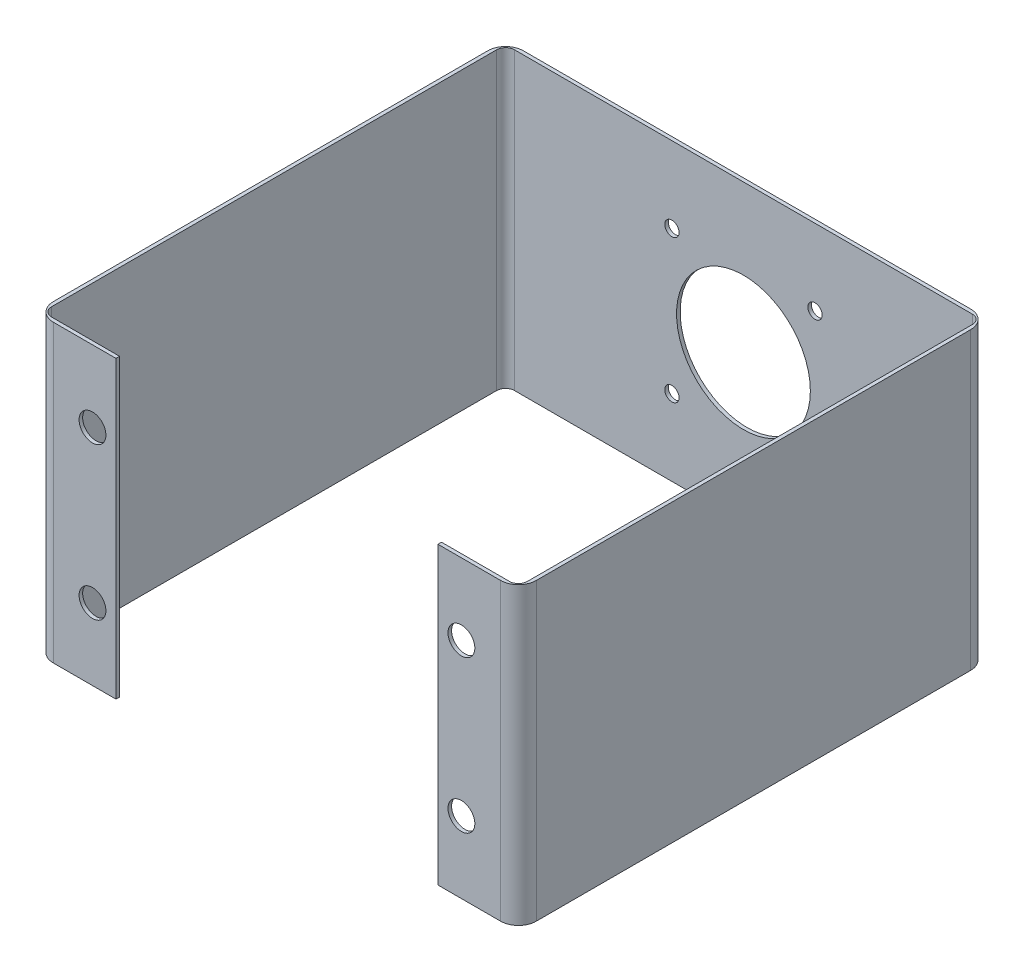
ISO-10303-21;
HEADER;
FILE_DESCRIPTION(('STEP AP214'),'2;1');
FILE_NAME('part.step','',(''),(''),'','','');
FILE_SCHEMA(('AUTOMOTIVE_DESIGN { 1 0 10303 214 1 1 1 1 }'));
ENDSEC;
DATA;
#1=APPLICATION_CONTEXT('core data for automotive mechanical design processes');
#2=APPLICATION_PROTOCOL_DEFINITION('international standard','automotive_design',2000,#1);
#3=PRODUCT_CONTEXT('',#1,'mechanical');
#4=PRODUCT('Part','Part','',(#3));
#5=PRODUCT_RELATED_PRODUCT_CATEGORY('part','',(#4));
#6=PRODUCT_DEFINITION_FORMATION('','',#4);
#7=PRODUCT_DEFINITION_CONTEXT('part definition',#1,'design');
#8=PRODUCT_DEFINITION('design','',#6,#7);
#9=PRODUCT_DEFINITION_SHAPE('','',#8);
#10=(LENGTH_UNIT() NAMED_UNIT(*) SI_UNIT(.MILLI.,.METRE.));
#11=(NAMED_UNIT(*) PLANE_ANGLE_UNIT() SI_UNIT($,.RADIAN.));
#12=(NAMED_UNIT(*) SI_UNIT($,.STERADIAN.) SOLID_ANGLE_UNIT());
#13=UNCERTAINTY_MEASURE_WITH_UNIT(LENGTH_MEASURE(1.E-05),#10,'distance_accuracy_value','');
#14=(GEOMETRIC_REPRESENTATION_CONTEXT(3) GLOBAL_UNCERTAINTY_ASSIGNED_CONTEXT((#13)) GLOBAL_UNIT_ASSIGNED_CONTEXT((#10,
#11,#12)) REPRESENTATION_CONTEXT('',''));
#15=CARTESIAN_POINT('',(0.,0.,0.));
#16=DIRECTION('',(0.,0.,1.));
#17=DIRECTION('',(1.,0.,0.));
#18=AXIS2_PLACEMENT_3D('',#15,#16,#17);
#19=CARTESIAN_POINT('',(-85.725,52.3875,83.439));
#20=DIRECTION('',(0.,0.,-1.));
#21=DIRECTION('',(-1.,0.,0.));
#22=AXIS2_PLACEMENT_3D('',#19,#20,#21);
#23=PLANE('',#22);
#24=CARTESIAN_POINT('',(-65.4812,-26.9875,83.439));
#25=DIRECTION('',(0.,0.,1.));
#26=DIRECTION('',(1.,0.,0.));
#27=AXIS2_PLACEMENT_3D('',#24,#25,#26);
#28=CIRCLE('',#27,4.7625);
#29=CARTESIAN_POINT('',(-60.7187,-26.9875,83.439));
#30=VERTEX_POINT('',#29);
#31=EDGE_CURVE('E382',#30,#30,#28,.T.);
#32=ORIENTED_EDGE('',*,*,#31,.F.);
#33=EDGE_LOOP('',(#32));
#34=FACE_BOUND('',#33,.T.);
#35=CARTESIAN_POINT('',(-65.4812,26.9875,83.439));
#36=DIRECTION('',(0.,0.,1.));
#37=DIRECTION('',(1.,0.,0.));
#38=AXIS2_PLACEMENT_3D('',#35,#36,#37);
#39=CIRCLE('',#38,4.7625);
#40=CARTESIAN_POINT('',(-60.7187,26.9875,83.439));
#41=VERTEX_POINT('',#40);
#42=EDGE_CURVE('E363',#41,#41,#39,.T.);
#43=ORIENTED_EDGE('',*,*,#42,.F.);
#44=EDGE_LOOP('',(#43));
#45=FACE_BOUND('',#44,.T.);
#46=DIRECTION('',(1.,0.,0.));
#47=VECTOR('',#46,1.);
#48=CARTESIAN_POINT('',(-85.725,52.3875,83.439));
#49=LINE('',#48,#47);
#50=CARTESIAN_POINT('',(-79.375,52.3875,83.439));
#51=VERTEX_POINT('',#50);
#52=CARTESIAN_POINT('',(-57.15,52.3875,83.439));
#53=VERTEX_POINT('',#52);
#54=EDGE_CURVE('E193',#51,#53,#49,.T.);
#55=ORIENTED_EDGE('',*,*,#54,.F.);
#56=DIRECTION('',(0.,-1.,0.));
#57=VECTOR('',#56,1.);
#58=CARTESIAN_POINT('',(-79.375,52.3875,83.439));
#59=LINE('',#58,#57);
#60=CARTESIAN_POINT('',(-79.375,-52.3875,83.439));
#61=VERTEX_POINT('',#60);
#62=EDGE_CURVE('E271',#51,#61,#59,.T.);
#63=ORIENTED_EDGE('',*,*,#62,.T.);
#64=DIRECTION('',(1.,0.,0.));
#65=VECTOR('',#64,1.);
#66=CARTESIAN_POINT('',(-85.725,-52.3875,83.439));
#67=LINE('',#66,#65);
#68=CARTESIAN_POINT('',(-57.15,-52.3875,83.439));
#69=VERTEX_POINT('',#68);
#70=EDGE_CURVE('E288',#61,#69,#67,.T.);
#71=ORIENTED_EDGE('',*,*,#70,.T.);
#72=DIRECTION('',(0.,1.,0.));
#73=VECTOR('',#72,1.);
#74=CARTESIAN_POINT('',(-57.15,52.3875,83.439));
#75=LINE('',#74,#73);
#76=EDGE_CURVE('E327',#69,#53,#75,.T.);
#77=ORIENTED_EDGE('',*,*,#76,.T.);
#78=EDGE_LOOP('',(#55,#63,#71,#77));
#79=FACE_BOUND('',#78,.T.);
#80=ADVANCED_FACE('F30',(#34,#45,#79),#23,.F.);
#81=CARTESIAN_POINT('',(-84.455,52.3875,82.169));
#82=DIRECTION('',(0.,0.,-1.));
#83=DIRECTION('',(-1.,0.,0.));
#84=AXIS2_PLACEMENT_3D('',#81,#82,#83);
#85=PLANE('',#84);
#86=CARTESIAN_POINT('',(-65.4812,-26.9875,82.169));
#87=DIRECTION('',(0.,0.,-1.));
#88=DIRECTION('',(-1.,0.,0.));
#89=AXIS2_PLACEMENT_3D('',#86,#87,#88);
#90=CIRCLE('',#89,4.7625);
#91=CARTESIAN_POINT('',(-70.2437,-26.9875,82.169));
#92=VERTEX_POINT('',#91);
#93=EDGE_CURVE('E385',#92,#92,#90,.F.);
#94=ORIENTED_EDGE('',*,*,#93,.T.);
#95=EDGE_LOOP('',(#94));
#96=FACE_BOUND('',#95,.T.);
#97=CARTESIAN_POINT('',(-65.4812,26.9875,82.169));
#98=DIRECTION('',(0.,0.,-1.));
#99=DIRECTION('',(-1.,0.,0.));
#100=AXIS2_PLACEMENT_3D('',#97,#98,#99);
#101=CIRCLE('',#100,4.7625);
#102=CARTESIAN_POINT('',(-70.2437,26.9875,82.169));
#103=VERTEX_POINT('',#102);
#104=EDGE_CURVE('E365',#103,#103,#101,.F.);
#105=ORIENTED_EDGE('',*,*,#104,.T.);
#106=EDGE_LOOP('',(#105));
#107=FACE_BOUND('',#106,.T.);
#108=DIRECTION('',(1.,0.,0.));
#109=VECTOR('',#108,1.);
#110=CARTESIAN_POINT('',(-84.455,-52.3875,82.169));
#111=LINE('',#110,#109);
#112=CARTESIAN_POINT('',(-81.28,-52.3875,82.169));
#113=VERTEX_POINT('',#112);
#114=CARTESIAN_POINT('',(-57.15,-52.3875,82.169));
#115=VERTEX_POINT('',#114);
#116=EDGE_CURVE('E330',#113,#115,#111,.T.);
#117=ORIENTED_EDGE('',*,*,#116,.F.);
#118=DIRECTION('',(0.,-1.,0.));
#119=VECTOR('',#118,1.);
#120=CARTESIAN_POINT('',(-81.28,52.3875,82.169));
#121=LINE('',#120,#119);
#122=CARTESIAN_POINT('',(-81.28,52.3875,82.169));
#123=VERTEX_POINT('',#122);
#124=EDGE_CURVE('E214',#113,#123,#121,.F.);
#125=ORIENTED_EDGE('',*,*,#124,.T.);
#126=DIRECTION('',(1.,0.,0.));
#127=VECTOR('',#126,1.);
#128=CARTESIAN_POINT('',(-84.455,52.3875,82.169));
#129=LINE('',#128,#127);
#130=CARTESIAN_POINT('',(-57.15,52.3875,82.169));
#131=VERTEX_POINT('',#130);
#132=EDGE_CURVE('E303',#123,#131,#129,.T.);
#133=ORIENTED_EDGE('',*,*,#132,.T.);
#134=DIRECTION('',(0.,1.,0.));
#135=VECTOR('',#134,1.);
#136=CARTESIAN_POINT('',(-57.15,52.3875,82.169));
#137=LINE('',#136,#135);
#138=EDGE_CURVE('E177',#115,#131,#137,.T.);
#139=ORIENTED_EDGE('',*,*,#138,.F.);
#140=EDGE_LOOP('',(#117,#125,#133,#139));
#141=FACE_BOUND('',#140,.T.);
#142=ADVANCED_FACE('F470',(#96,#107,#141),#85,.T.);
#143=CARTESIAN_POINT('',(-85.725,52.3875,83.439));
#144=DIRECTION('',(0.,1.,0.));
#145=DIRECTION('',(0.,0.,1.));
#146=AXIS2_PLACEMENT_3D('',#143,#144,#145);
#147=PLANE('',#146);
#148=DIRECTION('',(0.,0.,-1.));
#149=VECTOR('',#148,1.);
#150=CARTESIAN_POINT('',(85.725,52.3875,-83.439));
#151=LINE('',#150,#149);
#152=CARTESIAN_POINT('',(85.725,52.3875,77.089));
#153=VERTEX_POINT('',#152);
#154=CARTESIAN_POINT('',(85.725,52.3875,-77.089));
#155=VERTEX_POINT('',#154);
#156=EDGE_CURVE('E196',#153,#155,#151,.T.);
#157=ORIENTED_EDGE('',*,*,#156,.T.);
#158=CARTESIAN_POINT('',(79.375,52.3875,-77.089));
#159=DIRECTION('',(0.,1.,0.));
#160=DIRECTION('',(0.,0.,1.));
#161=AXIS2_PLACEMENT_3D('',#158,#159,#160);
#162=CIRCLE('',#161,6.35);
#163=CARTESIAN_POINT('',(79.375,52.3875,-83.439));
#164=VERTEX_POINT('',#163);
#165=EDGE_CURVE('E268',#155,#164,#162,.T.);
#166=ORIENTED_EDGE('',*,*,#165,.T.);
#167=DIRECTION('',(-1.,0.,0.));
#168=VECTOR('',#167,1.);
#169=CARTESIAN_POINT('',(-85.725,52.3875,-83.439));
#170=LINE('',#169,#168);
#171=CARTESIAN_POINT('',(-79.375,52.3875,-83.439));
#172=VERTEX_POINT('',#171);
#173=EDGE_CURVE('E202',#164,#172,#170,.T.);
#174=ORIENTED_EDGE('',*,*,#173,.T.);
#175=CARTESIAN_POINT('',(-79.375,52.3875,-77.089));
#176=DIRECTION('',(0.,1.,0.));
#177=DIRECTION('',(0.,0.,1.));
#178=AXIS2_PLACEMENT_3D('',#175,#176,#177);
#179=CIRCLE('',#178,6.35);
#180=CARTESIAN_POINT('',(-85.725,52.3875,-77.089));
#181=VERTEX_POINT('',#180);
#182=EDGE_CURVE('E263',#172,#181,#179,.T.);
#183=ORIENTED_EDGE('',*,*,#182,.T.);
#184=DIRECTION('',(0.,0.,1.));
#185=VECTOR('',#184,1.);
#186=CARTESIAN_POINT('',(-85.725,52.3875,-83.439));
#187=LINE('',#186,#185);
#188=CARTESIAN_POINT('',(-85.725,52.3875,77.089));
#189=VERTEX_POINT('',#188);
#190=EDGE_CURVE('E194',#181,#189,#187,.T.);
#191=ORIENTED_EDGE('',*,*,#190,.T.);
#192=CARTESIAN_POINT('',(-79.375,52.3875,77.089));
#193=DIRECTION('',(0.,1.,0.));
#194=DIRECTION('',(0.,0.,1.));
#195=AXIS2_PLACEMENT_3D('',#192,#193,#194);
#196=CIRCLE('',#195,6.35);
#197=EDGE_CURVE('E45',#189,#51,#196,.T.);
#198=ORIENTED_EDGE('',*,*,#197,.T.);
#199=ORIENTED_EDGE('',*,*,#54,.T.);
#200=DIRECTION('',(0.,0.,1.));
#201=VECTOR('',#200,1.);
#202=CARTESIAN_POINT('',(-57.15,52.3875,56.1451523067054));
#203=LINE('',#202,#201);
#204=EDGE_CURVE('E188',#131,#53,#203,.T.);
#205=ORIENTED_EDGE('',*,*,#204,.F.);
#206=ORIENTED_EDGE('',*,*,#132,.F.);
#207=CARTESIAN_POINT('',(-81.28,52.3875,78.994));
#208=DIRECTION('',(0.,1.,0.));
#209=DIRECTION('',(0.,0.,1.));
#210=AXIS2_PLACEMENT_3D('',#207,#208,#209);
#211=CIRCLE('',#210,3.175);
#212=CARTESIAN_POINT('',(-84.455,52.3875,78.994));
#213=VERTEX_POINT('',#212);
#214=EDGE_CURVE('E231',#123,#213,#211,.F.);
#215=ORIENTED_EDGE('',*,*,#214,.T.);
#216=DIRECTION('',(0.,0.,1.));
#217=VECTOR('',#216,1.);
#218=CARTESIAN_POINT('',(-84.455,52.3875,-82.169));
#219=LINE('',#218,#217);
#220=CARTESIAN_POINT('',(-84.455,52.3875,-78.994));
#221=VERTEX_POINT('',#220);
#222=EDGE_CURVE('E300',#221,#213,#219,.T.);
#223=ORIENTED_EDGE('',*,*,#222,.F.);
#224=CARTESIAN_POINT('',(-81.28,52.3875,-78.994));
#225=DIRECTION('',(0.,1.,0.));
#226=DIRECTION('',(0.,0.,1.));
#227=AXIS2_PLACEMENT_3D('',#224,#225,#226);
#228=CIRCLE('',#227,3.175);
#229=CARTESIAN_POINT('',(-81.28,52.3875,-82.169));
#230=VERTEX_POINT('',#229);
#231=EDGE_CURVE('E243',#221,#230,#228,.F.);
#232=ORIENTED_EDGE('',*,*,#231,.T.);
#233=DIRECTION('',(-1.,0.,0.));
#234=VECTOR('',#233,1.);
#235=CARTESIAN_POINT('',(-84.455,52.3875,-82.169));
#236=LINE('',#235,#234);
#237=CARTESIAN_POINT('',(81.28,52.3875,-82.169));
#238=VERTEX_POINT('',#237);
#239=EDGE_CURVE('E197',#238,#230,#236,.T.);
#240=ORIENTED_EDGE('',*,*,#239,.F.);
#241=CARTESIAN_POINT('',(81.28,52.3875,-78.994));
#242=DIRECTION('',(0.,1.,0.));
#243=DIRECTION('',(0.,0.,1.));
#244=AXIS2_PLACEMENT_3D('',#241,#242,#243);
#245=CIRCLE('',#244,3.175);
#246=CARTESIAN_POINT('',(84.455,52.3875,-78.994));
#247=VERTEX_POINT('',#246);
#248=EDGE_CURVE('E239',#238,#247,#245,.F.);
#249=ORIENTED_EDGE('',*,*,#248,.T.);
#250=DIRECTION('',(0.,0.,-1.));
#251=VECTOR('',#250,1.);
#252=CARTESIAN_POINT('',(84.455,52.3875,-82.169));
#253=LINE('',#252,#251);
#254=CARTESIAN_POINT('',(84.455,52.3875,78.994));
#255=VERTEX_POINT('',#254);
#256=EDGE_CURVE('E305',#255,#247,#253,.T.);
#257=ORIENTED_EDGE('',*,*,#256,.F.);
#258=CARTESIAN_POINT('',(81.28,52.3875,78.994));
#259=DIRECTION('',(0.,1.,0.));
#260=DIRECTION('',(0.,0.,1.));
#261=AXIS2_PLACEMENT_3D('',#258,#259,#260);
#262=CIRCLE('',#261,3.175);
#263=CARTESIAN_POINT('',(81.28,52.3875,82.169));
#264=VERTEX_POINT('',#263);
#265=EDGE_CURVE('E235',#255,#264,#262,.F.);
#266=ORIENTED_EDGE('',*,*,#265,.T.);
#267=CARTESIAN_POINT('',(57.15,52.3875,82.169));
#268=VERTEX_POINT('',#267);
#269=EDGE_CURVE('E187',#268,#264,#129,.T.);
#270=ORIENTED_EDGE('',*,*,#269,.F.);
#271=DIRECTION('',(0.,0.,-1.));
#272=VECTOR('',#271,1.);
#273=CARTESIAN_POINT('',(57.15,52.3875,56.1451523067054));
#274=LINE('',#273,#272);
#275=CARTESIAN_POINT('',(57.15,52.3875,83.439));
#276=VERTEX_POINT('',#275);
#277=EDGE_CURVE('E169',#276,#268,#274,.T.);
#278=ORIENTED_EDGE('',*,*,#277,.F.);
#279=CARTESIAN_POINT('',(79.375,52.3875,83.439));
#280=VERTEX_POINT('',#279);
#281=EDGE_CURVE('E184',#276,#280,#49,.T.);
#282=ORIENTED_EDGE('',*,*,#281,.T.);
#283=CARTESIAN_POINT('',(79.375,52.3875,77.089));
#284=DIRECTION('',(0.,1.,0.));
#285=DIRECTION('',(0.,0.,1.));
#286=AXIS2_PLACEMENT_3D('',#283,#284,#285);
#287=CIRCLE('',#286,6.35);
#288=EDGE_CURVE('E266',#280,#153,#287,.T.);
#289=ORIENTED_EDGE('',*,*,#288,.T.);
#290=EDGE_LOOP('',(#157,#166,#174,#183,#191,#198,#199,#205,#206,#215,#223,#232,#240,#249,#257,
#266,#270,#278,#282,#289));
#291=FACE_BOUND('',#290,.T.);
#292=ADVANCED_FACE('F183',(#291),#147,.T.);
#293=CARTESIAN_POINT('',(-85.725,52.3875,-83.439));
#294=DIRECTION('',(1.,0.,0.));
#295=DIRECTION('',(0.,0.,-1.));
#296=AXIS2_PLACEMENT_3D('',#293,#294,#295);
#297=PLANE('',#296);
#298=DIRECTION('',(0.,0.,1.));
#299=VECTOR('',#298,1.);
#300=CARTESIAN_POINT('',(-85.725,-52.3875,-83.439));
#301=LINE('',#300,#299);
#302=CARTESIAN_POINT('',(-85.725,-52.3875,-77.089));
#303=VERTEX_POINT('',#302);
#304=CARTESIAN_POINT('',(-85.725,-52.3875,77.089));
#305=VERTEX_POINT('',#304);
#306=EDGE_CURVE('E277',#303,#305,#301,.T.);
#307=ORIENTED_EDGE('',*,*,#306,.T.);
#308=DIRECTION('',(0.,-1.,0.));
#309=VECTOR('',#308,1.);
#310=CARTESIAN_POINT('',(-85.725,52.3875,77.089));
#311=LINE('',#310,#309);
#312=EDGE_CURVE('E11',#305,#189,#311,.F.);
#313=ORIENTED_EDGE('',*,*,#312,.T.);
#314=ORIENTED_EDGE('',*,*,#190,.F.);
#315=DIRECTION('',(0.,-1.,0.));
#316=VECTOR('',#315,1.);
#317=CARTESIAN_POINT('',(-85.725,52.3875,-77.089));
#318=LINE('',#317,#316);
#319=EDGE_CURVE('E38',#181,#303,#318,.T.);
#320=ORIENTED_EDGE('',*,*,#319,.T.);
#321=EDGE_LOOP('',(#307,#313,#314,#320));
#322=FACE_BOUND('',#321,.T.);
#323=ADVANCED_FACE('F276',(#322),#297,.F.);
#324=CARTESIAN_POINT('',(65.4812,26.9875,83.439));
#325=DIRECTION('',(0.,0.,1.));
#326=DIRECTION('',(1.,0.,0.));
#327=AXIS2_PLACEMENT_3D('',#324,#325,#326);
#328=CIRCLE('',#327,4.7625);
#329=CARTESIAN_POINT('',(70.2437,26.9875,83.439));
#330=VERTEX_POINT('',#329);
#331=EDGE_CURVE('E376',#330,#330,#328,.T.);
#332=ORIENTED_EDGE('',*,*,#331,.F.);
#333=EDGE_LOOP('',(#332));
#334=FACE_BOUND('',#333,.T.);
#335=CARTESIAN_POINT('',(65.4812,-26.9875,83.439));
#336=DIRECTION('',(0.,0.,1.));
#337=DIRECTION('',(1.,0.,0.));
#338=AXIS2_PLACEMENT_3D('',#335,#336,#337);
#339=CIRCLE('',#338,4.7625);
#340=CARTESIAN_POINT('',(70.2437,-26.9875,83.439));
#341=VERTEX_POINT('',#340);
#342=EDGE_CURVE('E370',#341,#341,#339,.T.);
#343=ORIENTED_EDGE('',*,*,#342,.F.);
#344=EDGE_LOOP('',(#343));
#345=FACE_BOUND('',#344,.T.);
#346=CARTESIAN_POINT('',(57.15,-52.3875,83.439));
#347=VERTEX_POINT('',#346);
#348=CARTESIAN_POINT('',(79.375,-52.3875,83.439));
#349=VERTEX_POINT('',#348);
#350=EDGE_CURVE('E285',#347,#349,#67,.T.);
#351=ORIENTED_EDGE('',*,*,#350,.T.);
#352=DIRECTION('',(0.,-1.,0.));
#353=VECTOR('',#352,1.);
#354=CARTESIAN_POINT('',(79.375,52.3875,83.439));
#355=LINE('',#354,#353);
#356=EDGE_CURVE('E192',#349,#280,#355,.F.);
#357=ORIENTED_EDGE('',*,*,#356,.T.);
#358=ORIENTED_EDGE('',*,*,#281,.F.);
#359=DIRECTION('',(0.,-1.,0.));
#360=VECTOR('',#359,1.);
#361=CARTESIAN_POINT('',(57.15,52.3875,83.439));
#362=LINE('',#361,#360);
#363=EDGE_CURVE('E166',#276,#347,#362,.T.);
#364=ORIENTED_EDGE('',*,*,#363,.T.);
#365=EDGE_LOOP('',(#351,#357,#358,#364));
#366=FACE_BOUND('',#365,.T.);
#367=ADVANCED_FACE('F190',(#334,#345,#366),#23,.F.);
#368=CARTESIAN_POINT('',(85.725,52.3875,-83.439));
#369=DIRECTION('',(-1.,0.,0.));
#370=DIRECTION('',(0.,0.,1.));
#371=AXIS2_PLACEMENT_3D('',#368,#369,#370);
#372=PLANE('',#371);
#373=DIRECTION('',(0.,0.,-1.));
#374=VECTOR('',#373,1.);
#375=CARTESIAN_POINT('',(85.725,-52.3875,-83.439));
#376=LINE('',#375,#374);
#377=CARTESIAN_POINT('',(85.725,-52.3875,77.089));
#378=VERTEX_POINT('',#377);
#379=CARTESIAN_POINT('',(85.725,-52.3875,-77.089));
#380=VERTEX_POINT('',#379);
#381=EDGE_CURVE('E295',#378,#380,#376,.T.);
#382=ORIENTED_EDGE('',*,*,#381,.T.);
#383=DIRECTION('',(0.,-1.,0.));
#384=VECTOR('',#383,1.);
#385=CARTESIAN_POINT('',(85.725,52.3875,-77.089));
#386=LINE('',#385,#384);
#387=EDGE_CURVE('E261',#380,#155,#386,.F.);
#388=ORIENTED_EDGE('',*,*,#387,.T.);
#389=ORIENTED_EDGE('',*,*,#156,.F.);
#390=DIRECTION('',(0.,-1.,0.));
#391=VECTOR('',#390,1.);
#392=CARTESIAN_POINT('',(85.725,52.3875,77.089));
#393=LINE('',#392,#391);
#394=EDGE_CURVE('E258',#153,#378,#393,.T.);
#395=ORIENTED_EDGE('',*,*,#394,.T.);
#396=EDGE_LOOP('',(#382,#388,#389,#395));
#397=FACE_BOUND('',#396,.T.);
#398=ADVANCED_FACE('F444',(#397),#372,.F.);
#399=CARTESIAN_POINT('',(-85.725,52.3875,-83.439));
#400=DIRECTION('',(0.,0.,1.));
#401=DIRECTION('',(1.,0.,0.));
#402=AXIS2_PLACEMENT_3D('',#399,#400,#401);
#403=PLANE('',#402);
#404=CARTESIAN_POINT('',(-25.4,-25.4,-83.439));
#405=DIRECTION('',(0.,0.,1.));
#406=DIRECTION('',(1.,0.,0.));
#407=AXIS2_PLACEMENT_3D('',#404,#405,#406);
#408=CIRCLE('',#407,2.54);
#409=CARTESIAN_POINT('',(-22.86,-25.4,-83.439));
#410=VERTEX_POINT('',#409);
#411=EDGE_CURVE('E412',#410,#410,#408,.F.);
#412=ORIENTED_EDGE('',*,*,#411,.F.);
#413=EDGE_LOOP('',(#412));
#414=FACE_BOUND('',#413,.T.);
#415=CARTESIAN_POINT('',(25.4,-25.4,-83.439));
#416=DIRECTION('',(0.,0.,1.));
#417=DIRECTION('',(1.,0.,0.));
#418=AXIS2_PLACEMENT_3D('',#415,#416,#417);
#419=CIRCLE('',#418,2.54);
#420=CARTESIAN_POINT('',(27.94,-25.4,-83.439));
#421=VERTEX_POINT('',#420);
#422=EDGE_CURVE('E406',#421,#421,#419,.F.);
#423=ORIENTED_EDGE('',*,*,#422,.F.);
#424=EDGE_LOOP('',(#423));
#425=FACE_BOUND('',#424,.T.);
#426=CARTESIAN_POINT('',(25.4,25.4,-83.439));
#427=DIRECTION('',(0.,0.,1.));
#428=DIRECTION('',(1.,0.,0.));
#429=AXIS2_PLACEMENT_3D('',#426,#427,#428);
#430=CIRCLE('',#429,2.54);
#431=CARTESIAN_POINT('',(27.94,25.4,-83.439));
#432=VERTEX_POINT('',#431);
#433=EDGE_CURVE('E400',#432,#432,#430,.F.);
#434=ORIENTED_EDGE('',*,*,#433,.F.);
#435=EDGE_LOOP('',(#434));
#436=FACE_BOUND('',#435,.T.);
#437=CARTESIAN_POINT('',(-25.4,25.4,-83.439));
#438=DIRECTION('',(0.,0.,1.));
#439=DIRECTION('',(1.,0.,0.));
#440=AXIS2_PLACEMENT_3D('',#437,#438,#439);
#441=CIRCLE('',#440,2.54);
#442=CARTESIAN_POINT('',(-22.86,25.4,-83.439));
#443=VERTEX_POINT('',#442);
#444=EDGE_CURVE('E394',#443,#443,#441,.F.);
#445=ORIENTED_EDGE('',*,*,#444,.F.);
#446=EDGE_LOOP('',(#445));
#447=FACE_BOUND('',#446,.T.);
#448=CARTESIAN_POINT('',(0.,0.,-83.439));
#449=DIRECTION('',(0.,0.,1.));
#450=DIRECTION('',(1.,0.,0.));
#451=AXIS2_PLACEMENT_3D('',#448,#449,#450);
#452=CIRCLE('',#451,23.749);
#453=CARTESIAN_POINT('',(23.749,0.,-83.439));
#454=VERTEX_POINT('',#453);
#455=EDGE_CURVE('E388',#454,#454,#452,.F.);
#456=ORIENTED_EDGE('',*,*,#455,.F.);
#457=EDGE_LOOP('',(#456));
#458=FACE_BOUND('',#457,.T.);
#459=ORIENTED_EDGE('',*,*,#173,.F.);
#460=DIRECTION('',(0.,-1.,0.));
#461=VECTOR('',#460,1.);
#462=CARTESIAN_POINT('',(79.375,52.3875,-83.439));
#463=LINE('',#462,#461);
#464=CARTESIAN_POINT('',(79.375,-52.3875,-83.439));
#465=VERTEX_POINT('',#464);
#466=EDGE_CURVE('E247',#164,#465,#463,.T.);
#467=ORIENTED_EDGE('',*,*,#466,.T.);
#468=DIRECTION('',(-1.,0.,0.));
#469=VECTOR('',#468,1.);
#470=CARTESIAN_POINT('',(-85.725,-52.3875,-83.439));
#471=LINE('',#470,#469);
#472=CARTESIAN_POINT('',(-79.375,-52.3875,-83.439));
#473=VERTEX_POINT('',#472);
#474=EDGE_CURVE('E298',#465,#473,#471,.T.);
#475=ORIENTED_EDGE('',*,*,#474,.T.);
#476=DIRECTION('',(0.,-1.,0.));
#477=VECTOR('',#476,1.);
#478=CARTESIAN_POINT('',(-79.375,52.3875,-83.439));
#479=LINE('',#478,#477);
#480=EDGE_CURVE('E245',#473,#172,#479,.F.);
#481=ORIENTED_EDGE('',*,*,#480,.T.);
#482=EDGE_LOOP('',(#459,#467,#475,#481));
#483=FACE_BOUND('',#482,.T.);
#484=ADVANCED_FACE('F441',(#414,#425,#436,#447,#458,#483),#403,.F.);
#485=CARTESIAN_POINT('',(-84.455,52.3875,-82.169));
#486=DIRECTION('',(1.,0.,0.));
#487=DIRECTION('',(0.,0.,-1.));
#488=AXIS2_PLACEMENT_3D('',#485,#486,#487);
#489=PLANE('',#488);
#490=ORIENTED_EDGE('',*,*,#222,.T.);
#491=DIRECTION('',(0.,-1.,0.));
#492=VECTOR('',#491,1.);
#493=CARTESIAN_POINT('',(-84.455,-52.3875,78.994));
#494=LINE('',#493,#492);
#495=CARTESIAN_POINT('',(-84.455,-52.3875,78.994));
#496=VERTEX_POINT('',#495);
#497=EDGE_CURVE('E211',#213,#496,#494,.T.);
#498=ORIENTED_EDGE('',*,*,#497,.T.);
#499=DIRECTION('',(0.,0.,1.));
#500=VECTOR('',#499,1.);
#501=CARTESIAN_POINT('',(-84.455,-52.3875,-82.169));
#502=LINE('',#501,#500);
#503=CARTESIAN_POINT('',(-84.455,-52.3875,-78.994));
#504=VERTEX_POINT('',#503);
#505=EDGE_CURVE('E321',#504,#496,#502,.T.);
#506=ORIENTED_EDGE('',*,*,#505,.F.);
#507=DIRECTION('',(0.,-1.,0.));
#508=VECTOR('',#507,1.);
#509=CARTESIAN_POINT('',(-84.455,52.3875,-78.994));
#510=LINE('',#509,#508);
#511=EDGE_CURVE('E209',#504,#221,#510,.F.);
#512=ORIENTED_EDGE('',*,*,#511,.T.);
#513=EDGE_LOOP('',(#490,#498,#506,#512));
#514=FACE_BOUND('',#513,.T.);
#515=ADVANCED_FACE('F323',(#514),#489,.T.);
#516=CARTESIAN_POINT('',(65.4812,26.9875,82.169));
#517=DIRECTION('',(0.,0.,-1.));
#518=DIRECTION('',(-1.,0.,0.));
#519=AXIS2_PLACEMENT_3D('',#516,#517,#518);
#520=CIRCLE('',#519,4.7625);
#521=CARTESIAN_POINT('',(60.7187,26.9875,82.169));
#522=VERTEX_POINT('',#521);
#523=EDGE_CURVE('E379',#522,#522,#520,.F.);
#524=ORIENTED_EDGE('',*,*,#523,.T.);
#525=EDGE_LOOP('',(#524));
#526=FACE_BOUND('',#525,.T.);
#527=CARTESIAN_POINT('',(65.4812,-26.9875,82.169));
#528=DIRECTION('',(0.,0.,-1.));
#529=DIRECTION('',(-1.,0.,0.));
#530=AXIS2_PLACEMENT_3D('',#527,#528,#529);
#531=CIRCLE('',#530,4.7625);
#532=CARTESIAN_POINT('',(60.7187,-26.9875,82.169));
#533=VERTEX_POINT('',#532);
#534=EDGE_CURVE('E373',#533,#533,#531,.F.);
#535=ORIENTED_EDGE('',*,*,#534,.T.);
#536=EDGE_LOOP('',(#535));
#537=FACE_BOUND('',#536,.T.);
#538=ORIENTED_EDGE('',*,*,#269,.T.);
#539=DIRECTION('',(0.,-1.,0.));
#540=VECTOR('',#539,1.);
#541=CARTESIAN_POINT('',(81.28,-52.3875,82.169));
#542=LINE('',#541,#540);
#543=CARTESIAN_POINT('',(81.28,-52.3875,82.169));
#544=VERTEX_POINT('',#543);
#545=EDGE_CURVE('E216',#264,#544,#542,.T.);
#546=ORIENTED_EDGE('',*,*,#545,.T.);
#547=CARTESIAN_POINT('',(57.15,-52.3875,82.169));
#548=VERTEX_POINT('',#547);
#549=EDGE_CURVE('E326',#548,#544,#111,.T.);
#550=ORIENTED_EDGE('',*,*,#549,.F.);
#551=DIRECTION('',(0.,-1.,0.));
#552=VECTOR('',#551,1.);
#553=CARTESIAN_POINT('',(57.15,52.3875,82.169));
#554=LINE('',#553,#552);
#555=EDGE_CURVE('E178',#268,#548,#554,.T.);
#556=ORIENTED_EDGE('',*,*,#555,.F.);
#557=EDGE_LOOP('',(#538,#546,#550,#556));
#558=FACE_BOUND('',#557,.T.);
#559=ADVANCED_FACE('F347',(#526,#537,#558),#85,.T.);
#560=CARTESIAN_POINT('',(84.455,52.3875,-82.169));
#561=DIRECTION('',(-1.,0.,0.));
#562=DIRECTION('',(0.,0.,1.));
#563=AXIS2_PLACEMENT_3D('',#560,#561,#562);
#564=PLANE('',#563);
#565=DIRECTION('',(0.,0.,-1.));
#566=VECTOR('',#565,1.);
#567=CARTESIAN_POINT('',(84.455,-52.3875,-82.169));
#568=LINE('',#567,#566);
#569=CARTESIAN_POINT('',(84.455,-52.3875,78.994));
#570=VERTEX_POINT('',#569);
#571=CARTESIAN_POINT('',(84.455,-52.3875,-78.994));
#572=VERTEX_POINT('',#571);
#573=EDGE_CURVE('E291',#570,#572,#568,.T.);
#574=ORIENTED_EDGE('',*,*,#573,.F.);
#575=DIRECTION('',(0.,-1.,0.));
#576=VECTOR('',#575,1.);
#577=CARTESIAN_POINT('',(84.455,52.3875,78.994));
#578=LINE('',#577,#576);
#579=EDGE_CURVE('E222',#570,#255,#578,.F.);
#580=ORIENTED_EDGE('',*,*,#579,.T.);
#581=ORIENTED_EDGE('',*,*,#256,.T.);
#582=DIRECTION('',(0.,-1.,0.));
#583=VECTOR('',#582,1.);
#584=CARTESIAN_POINT('',(84.455,-52.3875,-78.994));
#585=LINE('',#584,#583);
#586=EDGE_CURVE('E219',#247,#572,#585,.T.);
#587=ORIENTED_EDGE('',*,*,#586,.T.);
#588=EDGE_LOOP('',(#574,#580,#581,#587));
#589=FACE_BOUND('',#588,.T.);
#590=ADVANCED_FACE('F339',(#589),#564,.T.);
#591=CARTESIAN_POINT('',(-84.455,52.3875,-82.169));
#592=DIRECTION('',(0.,0.,1.));
#593=DIRECTION('',(1.,0.,0.));
#594=AXIS2_PLACEMENT_3D('',#591,#592,#593);
#595=PLANE('',#594);
#596=CARTESIAN_POINT('',(-25.4,-25.4,-82.169));
#597=DIRECTION('',(0.,0.,1.));
#598=DIRECTION('',(1.,0.,0.));
#599=AXIS2_PLACEMENT_3D('',#596,#597,#598);
#600=CIRCLE('',#599,2.54);
#601=CARTESIAN_POINT('',(-22.86,-25.4,-82.169));
#602=VERTEX_POINT('',#601);
#603=EDGE_CURVE('E415',#602,#602,#600,.T.);
#604=ORIENTED_EDGE('',*,*,#603,.F.);
#605=EDGE_LOOP('',(#604));
#606=FACE_BOUND('',#605,.T.);
#607=CARTESIAN_POINT('',(25.4,-25.4,-82.169));
#608=DIRECTION('',(0.,0.,1.));
#609=DIRECTION('',(1.,0.,0.));
#610=AXIS2_PLACEMENT_3D('',#607,#608,#609);
#611=CIRCLE('',#610,2.54);
#612=CARTESIAN_POINT('',(27.94,-25.4,-82.169));
#613=VERTEX_POINT('',#612);
#614=EDGE_CURVE('E409',#613,#613,#611,.T.);
#615=ORIENTED_EDGE('',*,*,#614,.F.);
#616=EDGE_LOOP('',(#615));
#617=FACE_BOUND('',#616,.T.);
#618=CARTESIAN_POINT('',(25.4,25.4,-82.169));
#619=DIRECTION('',(0.,0.,1.));
#620=DIRECTION('',(1.,0.,0.));
#621=AXIS2_PLACEMENT_3D('',#618,#619,#620);
#622=CIRCLE('',#621,2.54);
#623=CARTESIAN_POINT('',(27.94,25.4,-82.169));
#624=VERTEX_POINT('',#623);
#625=EDGE_CURVE('E403',#624,#624,#622,.T.);
#626=ORIENTED_EDGE('',*,*,#625,.F.);
#627=EDGE_LOOP('',(#626));
#628=FACE_BOUND('',#627,.T.);
#629=CARTESIAN_POINT('',(-25.4,25.4,-82.169));
#630=DIRECTION('',(0.,0.,1.));
#631=DIRECTION('',(1.,0.,0.));
#632=AXIS2_PLACEMENT_3D('',#629,#630,#631);
#633=CIRCLE('',#632,2.54);
#634=CARTESIAN_POINT('',(-22.86,25.4,-82.169));
#635=VERTEX_POINT('',#634);
#636=EDGE_CURVE('E397',#635,#635,#633,.T.);
#637=ORIENTED_EDGE('',*,*,#636,.F.);
#638=EDGE_LOOP('',(#637));
#639=FACE_BOUND('',#638,.T.);
#640=CARTESIAN_POINT('',(0.,0.,-82.169));
#641=DIRECTION('',(0.,0.,1.));
#642=DIRECTION('',(1.,0.,0.));
#643=AXIS2_PLACEMENT_3D('',#640,#641,#642);
#644=CIRCLE('',#643,23.749);
#645=CARTESIAN_POINT('',(23.749,0.,-82.169));
#646=VERTEX_POINT('',#645);
#647=EDGE_CURVE('E391',#646,#646,#644,.T.);
#648=ORIENTED_EDGE('',*,*,#647,.F.);
#649=EDGE_LOOP('',(#648));
#650=FACE_BOUND('',#649,.T.);
#651=DIRECTION('',(-1.,0.,0.));
#652=VECTOR('',#651,1.);
#653=CARTESIAN_POINT('',(-84.455,-52.3875,-82.169));
#654=LINE('',#653,#652);
#655=CARTESIAN_POINT('',(81.28,-52.3875,-82.169));
#656=VERTEX_POINT('',#655);
#657=CARTESIAN_POINT('',(-81.28,-52.3875,-82.169));
#658=VERTEX_POINT('',#657);
#659=EDGE_CURVE('E286',#656,#658,#654,.T.);
#660=ORIENTED_EDGE('',*,*,#659,.F.);
#661=DIRECTION('',(0.,-1.,0.));
#662=VECTOR('',#661,1.);
#663=CARTESIAN_POINT('',(81.28,52.3875,-82.169));
#664=LINE('',#663,#662);
#665=EDGE_CURVE('E227',#656,#238,#664,.F.);
#666=ORIENTED_EDGE('',*,*,#665,.T.);
#667=ORIENTED_EDGE('',*,*,#239,.T.);
#668=DIRECTION('',(0.,-1.,0.));
#669=VECTOR('',#668,1.);
#670=CARTESIAN_POINT('',(-81.28,-52.3875,-82.169));
#671=LINE('',#670,#669);
#672=EDGE_CURVE('E224',#230,#658,#671,.T.);
#673=ORIENTED_EDGE('',*,*,#672,.T.);
#674=EDGE_LOOP('',(#660,#666,#667,#673));
#675=FACE_BOUND('',#674,.T.);
#676=ADVANCED_FACE('F312',(#606,#617,#628,#639,#650,#675),#595,.T.);
#677=CARTESIAN_POINT('',(-85.725,-52.3875,83.439));
#678=DIRECTION('',(0.,1.,0.));
#679=DIRECTION('',(0.,0.,1.));
#680=AXIS2_PLACEMENT_3D('',#677,#678,#679);
#681=PLANE('',#680);
#682=ORIENTED_EDGE('',*,*,#474,.F.);
#683=CARTESIAN_POINT('',(79.375,-52.3875,-77.089));
#684=DIRECTION('',(0.,1.,0.));
#685=DIRECTION('',(0.,0.,1.));
#686=AXIS2_PLACEMENT_3D('',#683,#684,#685);
#687=CIRCLE('',#686,6.35);
#688=EDGE_CURVE('E256',#465,#380,#687,.F.);
#689=ORIENTED_EDGE('',*,*,#688,.T.);
#690=ORIENTED_EDGE('',*,*,#381,.F.);
#691=CARTESIAN_POINT('',(79.375,-52.3875,77.089));
#692=DIRECTION('',(0.,1.,0.));
#693=DIRECTION('',(0.,0.,1.));
#694=AXIS2_PLACEMENT_3D('',#691,#692,#693);
#695=CIRCLE('',#694,6.35);
#696=EDGE_CURVE('E254',#378,#349,#695,.F.);
#697=ORIENTED_EDGE('',*,*,#696,.T.);
#698=ORIENTED_EDGE('',*,*,#350,.F.);
#699=DIRECTION('',(0.,0.,-1.));
#700=VECTOR('',#699,1.);
#701=CARTESIAN_POINT('',(57.15,-52.3875,83.439));
#702=LINE('',#701,#700);
#703=EDGE_CURVE('E172',#347,#548,#702,.T.);
#704=ORIENTED_EDGE('',*,*,#703,.T.);
#705=ORIENTED_EDGE('',*,*,#549,.T.);
#706=CARTESIAN_POINT('',(81.28,-52.3875,78.994));
#707=DIRECTION('',(0.,1.,0.));
#708=DIRECTION('',(0.,0.,1.));
#709=AXIS2_PLACEMENT_3D('',#706,#707,#708);
#710=CIRCLE('',#709,3.175);
#711=EDGE_CURVE('E233',#544,#570,#710,.T.);
#712=ORIENTED_EDGE('',*,*,#711,.T.);
#713=ORIENTED_EDGE('',*,*,#573,.T.);
#714=CARTESIAN_POINT('',(81.28,-52.3875,-78.994));
#715=DIRECTION('',(0.,1.,0.));
#716=DIRECTION('',(0.,0.,1.));
#717=AXIS2_PLACEMENT_3D('',#714,#715,#716);
#718=CIRCLE('',#717,3.175);
#719=EDGE_CURVE('E237',#572,#656,#718,.T.);
#720=ORIENTED_EDGE('',*,*,#719,.T.);
#721=ORIENTED_EDGE('',*,*,#659,.T.);
#722=CARTESIAN_POINT('',(-81.28,-52.3875,-78.994));
#723=DIRECTION('',(0.,1.,0.));
#724=DIRECTION('',(0.,0.,1.));
#725=AXIS2_PLACEMENT_3D('',#722,#723,#724);
#726=CIRCLE('',#725,3.175);
#727=EDGE_CURVE('E241',#658,#504,#726,.T.);
#728=ORIENTED_EDGE('',*,*,#727,.T.);
#729=ORIENTED_EDGE('',*,*,#505,.T.);
#730=CARTESIAN_POINT('',(-81.28,-52.3875,78.994));
#731=DIRECTION('',(0.,1.,0.));
#732=DIRECTION('',(0.,0.,1.));
#733=AXIS2_PLACEMENT_3D('',#730,#731,#732);
#734=CIRCLE('',#733,3.175);
#735=EDGE_CURVE('E229',#496,#113,#734,.T.);
#736=ORIENTED_EDGE('',*,*,#735,.T.);
#737=ORIENTED_EDGE('',*,*,#116,.T.);
#738=DIRECTION('',(0.,0.,1.));
#739=VECTOR('',#738,1.);
#740=CARTESIAN_POINT('',(-57.15,-52.3875,83.439));
#741=LINE('',#740,#739);
#742=EDGE_CURVE('E206',#115,#69,#741,.T.);
#743=ORIENTED_EDGE('',*,*,#742,.T.);
#744=ORIENTED_EDGE('',*,*,#70,.F.);
#745=CARTESIAN_POINT('',(-79.375,-52.3875,77.089));
#746=DIRECTION('',(0.,1.,0.));
#747=DIRECTION('',(0.,0.,1.));
#748=AXIS2_PLACEMENT_3D('',#745,#746,#747);
#749=CIRCLE('',#748,6.35);
#750=EDGE_CURVE('E252',#61,#305,#749,.F.);
#751=ORIENTED_EDGE('',*,*,#750,.T.);
#752=ORIENTED_EDGE('',*,*,#306,.F.);
#753=CARTESIAN_POINT('',(-79.375,-52.3875,-77.089));
#754=DIRECTION('',(0.,1.,0.));
#755=DIRECTION('',(0.,0.,1.));
#756=AXIS2_PLACEMENT_3D('',#753,#754,#755);
#757=CIRCLE('',#756,6.35);
#758=EDGE_CURVE('E250',#303,#473,#757,.F.);
#759=ORIENTED_EDGE('',*,*,#758,.T.);
#760=EDGE_LOOP('',(#682,#689,#690,#697,#698,#704,#705,#712,#713,#720,#721,#728,#729,#736,#737,
#743,#744,#751,#752,#759));
#761=FACE_BOUND('',#760,.T.);
#762=ADVANCED_FACE('F282',(#761),#681,.F.);
#763=CARTESIAN_POINT('',(57.15,-52.3875,56.1451523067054));
#764=DIRECTION('',(1.,0.,0.));
#765=DIRECTION('',(0.,0.,-1.));
#766=AXIS2_PLACEMENT_3D('',#763,#764,#765);
#767=PLANE('',#766);
#768=ORIENTED_EDGE('',*,*,#277,.T.);
#769=ORIENTED_EDGE('',*,*,#555,.T.);
#770=ORIENTED_EDGE('',*,*,#703,.F.);
#771=ORIENTED_EDGE('',*,*,#363,.F.);
#772=EDGE_LOOP('',(#768,#769,#770,#771));
#773=FACE_BOUND('',#772,.T.);
#774=ADVANCED_FACE('F168',(#773),#767,.F.);
#775=CARTESIAN_POINT('',(-57.15,-52.3875,56.1451523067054));
#776=DIRECTION('',(-1.,0.,0.));
#777=DIRECTION('',(0.,0.,1.));
#778=AXIS2_PLACEMENT_3D('',#775,#776,#777);
#779=PLANE('',#778);
#780=ORIENTED_EDGE('',*,*,#742,.F.);
#781=ORIENTED_EDGE('',*,*,#138,.T.);
#782=ORIENTED_EDGE('',*,*,#204,.T.);
#783=ORIENTED_EDGE('',*,*,#76,.F.);
#784=EDGE_LOOP('',(#780,#781,#782,#783));
#785=FACE_BOUND('',#784,.T.);
#786=ADVANCED_FACE('F357',(#785),#779,.F.);
#787=CARTESIAN_POINT('',(-81.28,52.3875,78.994));
#788=DIRECTION('',(0.,1.,0.));
#789=DIRECTION('',(0.,0.,1.));
#790=AXIS2_PLACEMENT_3D('',#787,#788,#789);
#791=CYLINDRICAL_SURFACE('',#790,3.175);
#792=ORIENTED_EDGE('',*,*,#214,.F.);
#793=ORIENTED_EDGE('',*,*,#124,.F.);
#794=ORIENTED_EDGE('',*,*,#735,.F.);
#795=ORIENTED_EDGE('',*,*,#497,.F.);
#796=EDGE_LOOP('',(#792,#793,#794,#795));
#797=FACE_BOUND('',#796,.T.);
#798=ADVANCED_FACE('F513',(#797),#791,.F.);
#799=CARTESIAN_POINT('',(81.28,52.3875,78.994));
#800=DIRECTION('',(0.,1.,0.));
#801=DIRECTION('',(0.,0.,1.));
#802=AXIS2_PLACEMENT_3D('',#799,#800,#801);
#803=CYLINDRICAL_SURFACE('',#802,3.175);
#804=ORIENTED_EDGE('',*,*,#265,.F.);
#805=ORIENTED_EDGE('',*,*,#579,.F.);
#806=ORIENTED_EDGE('',*,*,#711,.F.);
#807=ORIENTED_EDGE('',*,*,#545,.F.);
#808=EDGE_LOOP('',(#804,#805,#806,#807));
#809=FACE_BOUND('',#808,.T.);
#810=ADVANCED_FACE('F344',(#809),#803,.F.);
#811=CARTESIAN_POINT('',(81.28,52.3875,-78.994));
#812=DIRECTION('',(0.,1.,0.));
#813=DIRECTION('',(0.,0.,1.));
#814=AXIS2_PLACEMENT_3D('',#811,#812,#813);
#815=CYLINDRICAL_SURFACE('',#814,3.175);
#816=ORIENTED_EDGE('',*,*,#248,.F.);
#817=ORIENTED_EDGE('',*,*,#665,.F.);
#818=ORIENTED_EDGE('',*,*,#719,.F.);
#819=ORIENTED_EDGE('',*,*,#586,.F.);
#820=EDGE_LOOP('',(#816,#817,#818,#819));
#821=FACE_BOUND('',#820,.T.);
#822=ADVANCED_FACE('F706',(#821),#815,.F.);
#823=CARTESIAN_POINT('',(-81.28,52.3875,-78.994));
#824=DIRECTION('',(0.,1.,0.));
#825=DIRECTION('',(0.,0.,1.));
#826=AXIS2_PLACEMENT_3D('',#823,#824,#825);
#827=CYLINDRICAL_SURFACE('',#826,3.175);
#828=ORIENTED_EDGE('',*,*,#231,.F.);
#829=ORIENTED_EDGE('',*,*,#511,.F.);
#830=ORIENTED_EDGE('',*,*,#727,.F.);
#831=ORIENTED_EDGE('',*,*,#672,.F.);
#832=EDGE_LOOP('',(#828,#829,#830,#831));
#833=FACE_BOUND('',#832,.T.);
#834=ADVANCED_FACE('F317',(#833),#827,.F.);
#835=CARTESIAN_POINT('',(79.375,52.3875,-77.089));
#836=DIRECTION('',(0.,-1.,0.));
#837=DIRECTION('',(0.,0.,-1.));
#838=AXIS2_PLACEMENT_3D('',#835,#836,#837);
#839=CYLINDRICAL_SURFACE('',#838,6.35);
#840=ORIENTED_EDGE('',*,*,#165,.F.);
#841=ORIENTED_EDGE('',*,*,#387,.F.);
#842=ORIENTED_EDGE('',*,*,#688,.F.);
#843=ORIENTED_EDGE('',*,*,#466,.F.);
#844=EDGE_LOOP('',(#840,#841,#842,#843));
#845=FACE_BOUND('',#844,.T.);
#846=ADVANCED_FACE('F452',(#845),#839,.T.);
#847=CARTESIAN_POINT('',(79.375,52.3875,77.089));
#848=DIRECTION('',(0.,-1.,0.));
#849=DIRECTION('',(0.,0.,-1.));
#850=AXIS2_PLACEMENT_3D('',#847,#848,#849);
#851=CYLINDRICAL_SURFACE('',#850,6.35);
#852=ORIENTED_EDGE('',*,*,#288,.F.);
#853=ORIENTED_EDGE('',*,*,#356,.F.);
#854=ORIENTED_EDGE('',*,*,#696,.F.);
#855=ORIENTED_EDGE('',*,*,#394,.F.);
#856=EDGE_LOOP('',(#852,#853,#854,#855));
#857=FACE_BOUND('',#856,.T.);
#858=ADVANCED_FACE('F459',(#857),#851,.T.);
#859=CARTESIAN_POINT('',(-79.375,52.3875,77.089));
#860=DIRECTION('',(0.,-1.,0.));
#861=DIRECTION('',(0.,0.,-1.));
#862=AXIS2_PLACEMENT_3D('',#859,#860,#861);
#863=CYLINDRICAL_SURFACE('',#862,6.35);
#864=ORIENTED_EDGE('',*,*,#197,.F.);
#865=ORIENTED_EDGE('',*,*,#312,.F.);
#866=ORIENTED_EDGE('',*,*,#750,.F.);
#867=ORIENTED_EDGE('',*,*,#62,.F.);
#868=EDGE_LOOP('',(#864,#865,#866,#867));
#869=FACE_BOUND('',#868,.T.);
#870=ADVANCED_FACE('F461',(#869),#863,.T.);
#871=CARTESIAN_POINT('',(-79.375,52.3875,-77.089));
#872=DIRECTION('',(0.,-1.,0.));
#873=DIRECTION('',(0.,0.,-1.));
#874=AXIS2_PLACEMENT_3D('',#871,#872,#873);
#875=CYLINDRICAL_SURFACE('',#874,6.35);
#876=ORIENTED_EDGE('',*,*,#182,.F.);
#877=ORIENTED_EDGE('',*,*,#480,.F.);
#878=ORIENTED_EDGE('',*,*,#758,.F.);
#879=ORIENTED_EDGE('',*,*,#319,.F.);
#880=EDGE_LOOP('',(#876,#877,#878,#879));
#881=FACE_BOUND('',#880,.T.);
#882=ADVANCED_FACE('F32',(#881),#875,.T.);
#883=CARTESIAN_POINT('',(-65.4812,26.9875,-83.44));
#884=DIRECTION('',(0.,0.,1.));
#885=DIRECTION('',(1.,0.,0.));
#886=AXIS2_PLACEMENT_3D('',#883,#884,#885);
#887=CYLINDRICAL_SURFACE('',#886,4.7625);
#888=ORIENTED_EDGE('',*,*,#104,.F.);
#889=EDGE_LOOP('',(#888));
#890=FACE_BOUND('',#889,.T.);
#891=ORIENTED_EDGE('',*,*,#42,.T.);
#892=EDGE_LOOP('',(#891));
#893=FACE_BOUND('',#892,.T.);
#894=ADVANCED_FACE('F495',(#890,#893),#887,.F.);
#895=CARTESIAN_POINT('',(65.4812,-26.9875,-83.44));
#896=DIRECTION('',(0.,0.,1.));
#897=DIRECTION('',(1.,0.,0.));
#898=AXIS2_PLACEMENT_3D('',#895,#896,#897);
#899=CYLINDRICAL_SURFACE('',#898,4.7625);
#900=ORIENTED_EDGE('',*,*,#534,.F.);
#901=EDGE_LOOP('',(#900));
#902=FACE_BOUND('',#901,.T.);
#903=ORIENTED_EDGE('',*,*,#342,.T.);
#904=EDGE_LOOP('',(#903));
#905=FACE_BOUND('',#904,.T.);
#906=ADVANCED_FACE('F492',(#902,#905),#899,.F.);
#907=CARTESIAN_POINT('',(65.4812,26.9875,-83.44));
#908=DIRECTION('',(0.,0.,1.));
#909=DIRECTION('',(1.,0.,0.));
#910=AXIS2_PLACEMENT_3D('',#907,#908,#909);
#911=CYLINDRICAL_SURFACE('',#910,4.7625);
#912=ORIENTED_EDGE('',*,*,#523,.F.);
#913=EDGE_LOOP('',(#912));
#914=FACE_BOUND('',#913,.T.);
#915=ORIENTED_EDGE('',*,*,#331,.T.);
#916=EDGE_LOOP('',(#915));
#917=FACE_BOUND('',#916,.T.);
#918=ADVANCED_FACE('F494',(#914,#917),#911,.F.);
#919=CARTESIAN_POINT('',(-65.4812,-26.9875,-83.44));
#920=DIRECTION('',(0.,0.,1.));
#921=DIRECTION('',(1.,0.,0.));
#922=AXIS2_PLACEMENT_3D('',#919,#920,#921);
#923=CYLINDRICAL_SURFACE('',#922,4.7625);
#924=ORIENTED_EDGE('',*,*,#93,.F.);
#925=EDGE_LOOP('',(#924));
#926=FACE_BOUND('',#925,.T.);
#927=ORIENTED_EDGE('',*,*,#31,.T.);
#928=EDGE_LOOP('',(#927));
#929=FACE_BOUND('',#928,.T.);
#930=ADVANCED_FACE('F437',(#926,#929),#923,.F.);
#931=CARTESIAN_POINT('',(0.,0.,-83.44));
#932=DIRECTION('',(0.,0.,1.));
#933=DIRECTION('',(1.,0.,0.));
#934=AXIS2_PLACEMENT_3D('',#931,#932,#933);
#935=CYLINDRICAL_SURFACE('',#934,23.749);
#936=ORIENTED_EDGE('',*,*,#647,.T.);
#937=EDGE_LOOP('',(#936));
#938=FACE_BOUND('',#937,.T.);
#939=ORIENTED_EDGE('',*,*,#455,.T.);
#940=EDGE_LOOP('',(#939));
#941=FACE_BOUND('',#940,.T.);
#942=ADVANCED_FACE('F433',(#938,#941),#935,.F.);
#943=CARTESIAN_POINT('',(-25.4,25.4,-83.44));
#944=DIRECTION('',(0.,0.,1.));
#945=DIRECTION('',(1.,0.,0.));
#946=AXIS2_PLACEMENT_3D('',#943,#944,#945);
#947=CYLINDRICAL_SURFACE('',#946,2.54);
#948=ORIENTED_EDGE('',*,*,#636,.T.);
#949=EDGE_LOOP('',(#948));
#950=FACE_BOUND('',#949,.T.);
#951=ORIENTED_EDGE('',*,*,#444,.T.);
#952=EDGE_LOOP('',(#951));
#953=FACE_BOUND('',#952,.T.);
#954=ADVANCED_FACE('F436',(#950,#953),#947,.F.);
#955=CARTESIAN_POINT('',(25.4,25.4,-83.44));
#956=DIRECTION('',(0.,0.,1.));
#957=DIRECTION('',(1.,0.,0.));
#958=AXIS2_PLACEMENT_3D('',#955,#956,#957);
#959=CYLINDRICAL_SURFACE('',#958,2.54);
#960=ORIENTED_EDGE('',*,*,#625,.T.);
#961=EDGE_LOOP('',(#960));
#962=FACE_BOUND('',#961,.T.);
#963=ORIENTED_EDGE('',*,*,#433,.T.);
#964=EDGE_LOOP('',(#963));
#965=FACE_BOUND('',#964,.T.);
#966=ADVANCED_FACE('F642',(#962,#965),#959,.F.);
#967=CARTESIAN_POINT('',(25.4,-25.4,-83.44));
#968=DIRECTION('',(0.,0.,1.));
#969=DIRECTION('',(1.,0.,0.));
#970=AXIS2_PLACEMENT_3D('',#967,#968,#969);
#971=CYLINDRICAL_SURFACE('',#970,2.54);
#972=ORIENTED_EDGE('',*,*,#614,.T.);
#973=EDGE_LOOP('',(#972));
#974=FACE_BOUND('',#973,.T.);
#975=ORIENTED_EDGE('',*,*,#422,.T.);
#976=EDGE_LOOP('',(#975));
#977=FACE_BOUND('',#976,.T.);
#978=ADVANCED_FACE('F652',(#974,#977),#971,.F.);
#979=CARTESIAN_POINT('',(-25.4,-25.4,-83.44));
#980=DIRECTION('',(0.,0.,1.));
#981=DIRECTION('',(1.,0.,0.));
#982=AXIS2_PLACEMENT_3D('',#979,#980,#981);
#983=CYLINDRICAL_SURFACE('',#982,2.54);
#984=ORIENTED_EDGE('',*,*,#603,.T.);
#985=EDGE_LOOP('',(#984));
#986=FACE_BOUND('',#985,.T.);
#987=ORIENTED_EDGE('',*,*,#411,.T.);
#988=EDGE_LOOP('',(#987));
#989=FACE_BOUND('',#988,.T.);
#990=ADVANCED_FACE('F419',(#986,#989),#983,.F.);
#991=CLOSED_SHELL('',(#80,#142,#292,#323,#367,#398,#484,#515,#559,#590,#676,#762,#774,#786,#798,
#810,#822,#834,#846,#858,#870,#882,#894,#906,#918,#930,#942,#954,#966,#978,#990));
#992=MANIFOLD_SOLID_BREP('B2',#991);
#993=ADVANCED_BREP_SHAPE_REPRESENTATION('',(#18,#992),#14);
#994=SHAPE_DEFINITION_REPRESENTATION(#9,#993);
ENDSEC;
END-ISO-10303-21;
